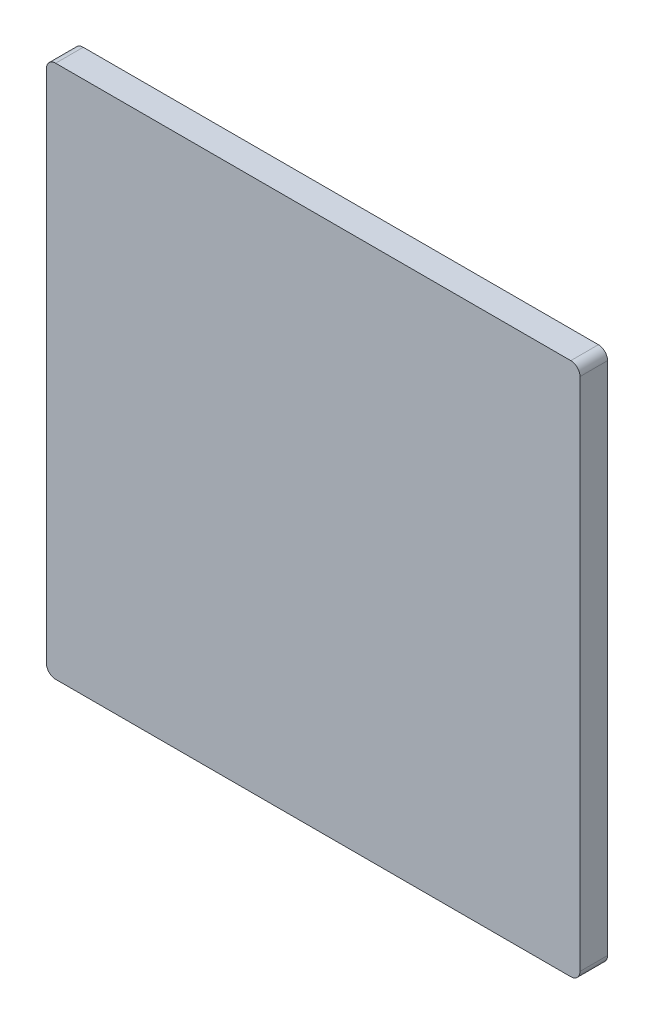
from build123d import *

# Parameters (mm, degrees)
EXTRUDE1_DEPTH = 4.7625


with BuildPart() as part:
    # Sketch1 → Extrude1 (new body)
    with BuildSketch(Plane.XY):
        with BuildLine():
            Line((-44.45, 46.0375), (44.45, 46.0375))
            ThreePointArc((44.45, 46.0375), (45.572532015, 45.572532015), (46.0375, 44.45))
            Line((46.0375, 44.45), (46.0375, -44.45))
            ThreePointArc((46.0375, -44.45), (45.572532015, -45.572532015), (44.45, -46.0375))
            Line((44.45, -46.0375), (-44.45, -46.0375))
            ThreePointArc((-44.45, -46.0375), (-45.572532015, -45.572532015), (-46.0375, -44.45))
            Line((-46.0375, -44.45), (-46.0375, 44.45))
            ThreePointArc((-46.0375, 44.45), (-45.572532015, 45.572532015), (-44.45, 46.0375))
        make_face()
    extrude(amount=EXTRUDE1_DEPTH)


solid = part.part
